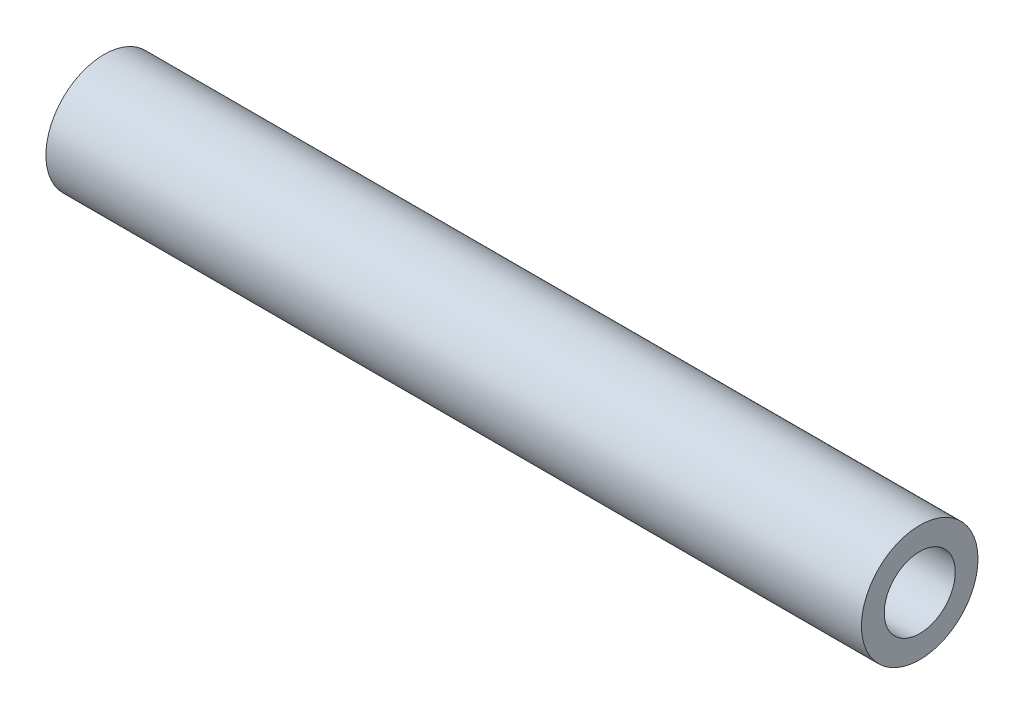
from build123d import *

# Parameters (mm, degrees)
SKETCH1_R           = 5
SKETCH1_R_2         = 3.05
BOSS_EXTRUDE1_DEPTH = 70


with BuildPart() as part:
    # Sketch1 → Boss-Extrude1 (new body)
    with BuildSketch(Plane(origin=(0, 0, 0), x_dir=(0, 0, -1), z_dir=(1, 0, 0))):
        Circle(SKETCH1_R)
        Circle(SKETCH1_R_2, mode=Mode.SUBTRACT)
    extrude(amount=BOSS_EXTRUDE1_DEPTH)


solid = part.part
